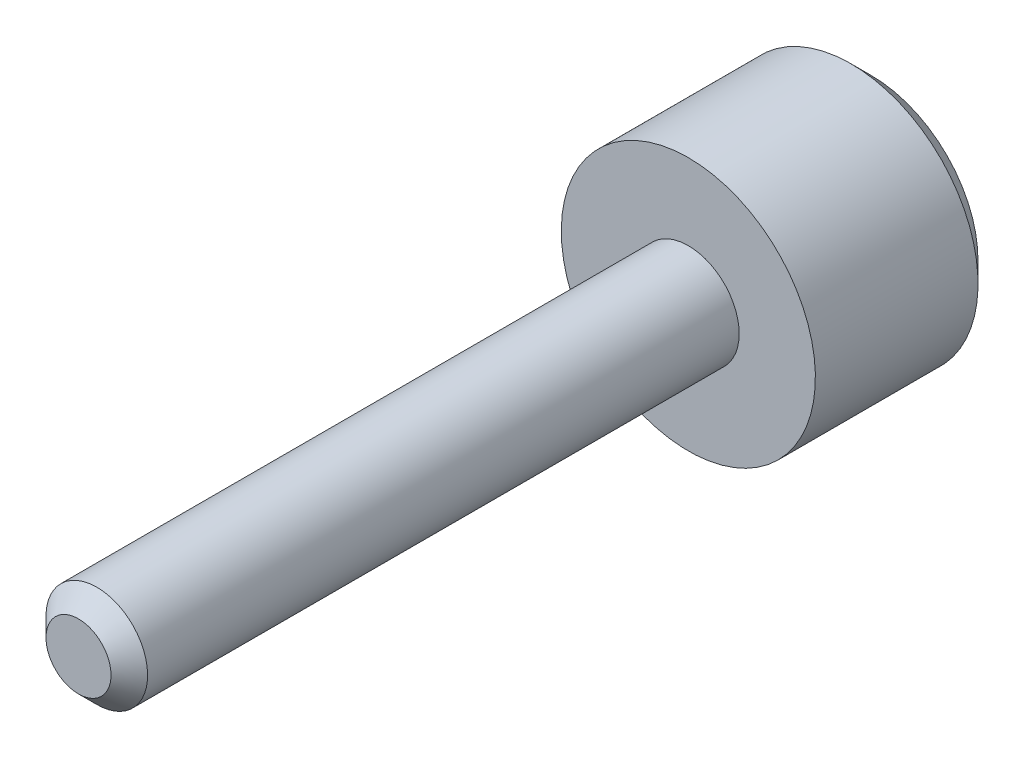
ISO-10303-21;
HEADER;
FILE_DESCRIPTION(('STEP AP214'),'2;1');
FILE_NAME('part.step','',(''),(''),'','','');
FILE_SCHEMA(('AUTOMOTIVE_DESIGN { 1 0 10303 214 1 1 1 1 }'));
ENDSEC;
DATA;
#1=APPLICATION_CONTEXT('core data for automotive mechanical design processes');
#2=APPLICATION_PROTOCOL_DEFINITION('international standard','automotive_design',2000,#1);
#3=PRODUCT_CONTEXT('',#1,'mechanical');
#4=PRODUCT('Part','Part','',(#3));
#5=PRODUCT_RELATED_PRODUCT_CATEGORY('part','',(#4));
#6=PRODUCT_DEFINITION_FORMATION('','',#4);
#7=PRODUCT_DEFINITION_CONTEXT('part definition',#1,'design');
#8=PRODUCT_DEFINITION('design','',#6,#7);
#9=PRODUCT_DEFINITION_SHAPE('','',#8);
#10=(LENGTH_UNIT() NAMED_UNIT(*) SI_UNIT(.MILLI.,.METRE.));
#11=(NAMED_UNIT(*) PLANE_ANGLE_UNIT() SI_UNIT($,.RADIAN.));
#12=(NAMED_UNIT(*) SI_UNIT($,.STERADIAN.) SOLID_ANGLE_UNIT());
#13=UNCERTAINTY_MEASURE_WITH_UNIT(LENGTH_MEASURE(1.E-05),#10,'distance_accuracy_value','');
#14=(GEOMETRIC_REPRESENTATION_CONTEXT(3) GLOBAL_UNCERTAINTY_ASSIGNED_CONTEXT((#13)) GLOBAL_UNIT_ASSIGNED_CONTEXT((#10,
#11,#12)) REPRESENTATION_CONTEXT('',''));
#15=CARTESIAN_POINT('',(0.,0.,0.));
#16=DIRECTION('',(0.,0.,1.));
#17=DIRECTION('',(1.,0.,0.));
#18=AXIS2_PLACEMENT_3D('',#15,#16,#17);
#19=CARTESIAN_POINT('',(0.,0.,0.));
#20=DIRECTION('',(0.,0.,1.));
#21=DIRECTION('',(0.5,-0.866025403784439,0.));
#22=AXIS2_PLACEMENT_3D('',#19,#20,#21);
#23=CONICAL_SURFACE('',#22,5.25,0.785398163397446);
#24=CARTESIAN_POINT('',(0.,0.,1.));
#25=DIRECTION('',(0.,0.,1.));
#26=DIRECTION('',(0.5,-0.866025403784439,0.));
#27=AXIS2_PLACEMENT_3D('',#24,#25,#26);
#28=CIRCLE('',#27,6.25);
#29=CARTESIAN_POINT('',(3.125,-5.41265877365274,1.));
#30=VERTEX_POINT('',#29);
#31=EDGE_CURVE('E94',#30,#30,#28,.T.);
#32=ORIENTED_EDGE('',*,*,#31,.F.);
#33=EDGE_LOOP('',(#32));
#34=FACE_BOUND('',#33,.T.);
#35=CARTESIAN_POINT('',(0.,0.,0.));
#36=DIRECTION('',(0.,0.,1.));
#37=DIRECTION('',(0.5,-0.866025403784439,0.));
#38=AXIS2_PLACEMENT_3D('',#35,#36,#37);
#39=CIRCLE('',#38,5.25);
#40=CARTESIAN_POINT('',(2.625,-4.5466333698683,0.));
#41=VERTEX_POINT('',#40);
#42=EDGE_CURVE('E91',#41,#41,#39,.F.);
#43=ORIENTED_EDGE('',*,*,#42,.F.);
#44=EDGE_LOOP('',(#43));
#45=FACE_BOUND('',#44,.T.);
#46=ADVANCED_FACE('F14',(#34,#45),#23,.T.);
#47=CARTESIAN_POINT('',(0.,0.,0.));
#48=DIRECTION('',(0.,0.,1.));
#49=DIRECTION('',(0.5,-0.866025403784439,0.));
#50=AXIS2_PLACEMENT_3D('',#47,#48,#49);
#51=PLANE('',#50);
#52=CARTESIAN_POINT('',(0.,0.,0.));
#53=DIRECTION('',(0.,0.,-1.));
#54=DIRECTION('',(-1.,0.,0.));
#55=AXIS2_PLACEMENT_3D('',#52,#53,#54);
#56=CIRCLE('',#55,2.75);
#57=CARTESIAN_POINT('',(-2.75,0.,0.));
#58=VERTEX_POINT('',#57);
#59=EDGE_CURVE('E305',#58,#58,#56,.T.);
#60=ORIENTED_EDGE('',*,*,#59,.F.);
#61=EDGE_LOOP('',(#60));
#62=FACE_BOUND('',#61,.T.);
#63=ORIENTED_EDGE('',*,*,#42,.T.);
#64=EDGE_LOOP('',(#63));
#65=FACE_BOUND('',#64,.T.);
#66=ADVANCED_FACE('F141',(#62,#65),#51,.F.);
#67=CARTESIAN_POINT('',(0.,0.,0.));
#68=DIRECTION('',(0.,0.,-1.));
#69=DIRECTION('',(-0.5,0.866025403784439,0.));
#70=AXIS2_PLACEMENT_3D('',#67,#68,#69);
#71=CYLINDRICAL_SURFACE('',#70,6.25);
#72=ORIENTED_EDGE('',*,*,#31,.T.);
#73=EDGE_LOOP('',(#72));
#74=FACE_BOUND('',#73,.T.);
#75=CARTESIAN_POINT('',(0.,0.,9.));
#76=DIRECTION('',(0.,0.,-1.));
#77=DIRECTION('',(-0.5,0.866025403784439,0.));
#78=AXIS2_PLACEMENT_3D('',#75,#76,#77);
#79=CIRCLE('',#78,6.25);
#80=CARTESIAN_POINT('',(-3.125,5.41265877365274,9.));
#81=VERTEX_POINT('',#80);
#82=EDGE_CURVE('E88',#81,#81,#79,.T.);
#83=ORIENTED_EDGE('',*,*,#82,.T.);
#84=EDGE_LOOP('',(#83));
#85=FACE_BOUND('',#84,.T.);
#86=ADVANCED_FACE('F131',(#74,#85),#71,.T.);
#87=CARTESIAN_POINT('',(3.68060796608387,2.125,9.));
#88=DIRECTION('',(0.,0.,-1.));
#89=DIRECTION('',(-0.5,0.866025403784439,0.));
#90=AXIS2_PLACEMENT_3D('',#87,#88,#89);
#91=PLANE('',#90);
#92=ORIENTED_EDGE('',*,*,#82,.F.);
#93=EDGE_LOOP('',(#92));
#94=FACE_BOUND('',#93,.T.);
#95=CARTESIAN_POINT('',(0.,0.,9.));
#96=DIRECTION('',(0.,0.,-1.));
#97=DIRECTION('',(-0.5,0.866025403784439,0.));
#98=AXIS2_PLACEMENT_3D('',#95,#96,#97);
#99=CIRCLE('',#98,2.5);
#100=CARTESIAN_POINT('',(-1.25,2.1650635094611,9.));
#101=VERTEX_POINT('',#100);
#102=EDGE_CURVE('E80',#101,#101,#99,.T.);
#103=ORIENTED_EDGE('',*,*,#102,.T.);
#104=EDGE_LOOP('',(#103));
#105=FACE_BOUND('',#104,.T.);
#106=ADVANCED_FACE('F129',(#94,#105),#91,.F.);
#107=CARTESIAN_POINT('',(-1.25,2.1650635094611,39.));
#108=DIRECTION('',(0.,0.,1.));
#109=DIRECTION('',(0.5,-0.866025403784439,0.));
#110=AXIS2_PLACEMENT_3D('',#107,#108,#109);
#111=PLANE('',#110);
#112=CARTESIAN_POINT('',(0.,0.,39.));
#113=DIRECTION('',(0.,0.,1.));
#114=DIRECTION('',(0.866025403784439,0.5,0.));
#115=AXIS2_PLACEMENT_3D('',#112,#113,#114);
#116=CIRCLE('',#115,1.6);
#117=CARTESIAN_POINT('',(1.38564064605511,0.800000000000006,39.));
#118=VERTEX_POINT('',#117);
#119=EDGE_CURVE('E22',#118,#118,#116,.T.);
#120=ORIENTED_EDGE('',*,*,#119,.T.);
#121=EDGE_LOOP('',(#120));
#122=FACE_BOUND('',#121,.T.);
#123=ADVANCED_FACE('F118',(#122),#111,.T.);
#124=CARTESIAN_POINT('',(0.,0.,19.));
#125=DIRECTION('',(0.,0.,-1.));
#126=DIRECTION('',(-0.5,0.866025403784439,0.));
#127=AXIS2_PLACEMENT_3D('',#124,#125,#126);
#128=CYLINDRICAL_SURFACE('',#127,2.5);
#129=CARTESIAN_POINT('',(0.,0.,38.1));
#130=DIRECTION('',(0.,0.,1.));
#131=DIRECTION('',(0.866025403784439,0.5,0.));
#132=AXIS2_PLACEMENT_3D('',#129,#130,#131);
#133=CIRCLE('',#132,2.5);
#134=CARTESIAN_POINT('',(2.16506350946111,1.25000000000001,38.1));
#135=VERTEX_POINT('',#134);
#136=EDGE_CURVE('E97',#135,#135,#133,.F.);
#137=ORIENTED_EDGE('',*,*,#136,.T.);
#138=EDGE_LOOP('',(#137));
#139=FACE_BOUND('',#138,.T.);
#140=ORIENTED_EDGE('',*,*,#102,.F.);
#141=EDGE_LOOP('',(#140));
#142=FACE_BOUND('',#141,.T.);
#143=ADVANCED_FACE('F122',(#139,#142),#128,.T.);
#144=CARTESIAN_POINT('',(0.,0.,38.1));
#145=DIRECTION('',(0.,0.,-1.));
#146=DIRECTION('',(-0.866025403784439,-0.5,0.));
#147=AXIS2_PLACEMENT_3D('',#144,#145,#146);
#148=CONICAL_SURFACE('',#147,2.5,0.785398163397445);
#149=ORIENTED_EDGE('',*,*,#119,.F.);
#150=EDGE_LOOP('',(#149));
#151=FACE_BOUND('',#150,.T.);
#152=ORIENTED_EDGE('',*,*,#136,.F.);
#153=EDGE_LOOP('',(#152));
#154=FACE_BOUND('',#153,.T.);
#155=ADVANCED_FACE('F16',(#151,#154),#148,.T.);
#156=CARTESIAN_POINT('',(0.,0.,4.));
#157=DIRECTION('',(0.,0.,-1.));
#158=DIRECTION('',(-1.,0.,0.));
#159=AXIS2_PLACEMENT_3D('',#156,#157,#158);
#160=PLANE('',#159);
#161=CARTESIAN_POINT('',(0.,0.,4.));
#162=DIRECTION('',(0.,0.,-1.));
#163=DIRECTION('',(-1.,0.,0.));
#164=AXIS2_PLACEMENT_3D('',#161,#162,#163);
#165=CIRCLE('',#164,2.75);
#166=CARTESIAN_POINT('',(-2.75,0.,4.));
#167=VERTEX_POINT('',#166);
#168=EDGE_CURVE('E73',#167,#167,#165,.T.);
#169=ORIENTED_EDGE('',*,*,#168,.T.);
#170=EDGE_LOOP('',(#169));
#171=FACE_BOUND('',#170,.T.);
#172=DIRECTION('',(-0.866025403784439,-0.5,0.));
#173=VECTOR('',#172,1.);
#174=CARTESIAN_POINT('',(-2.,1.15470053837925,4.));
#175=LINE('',#174,#173);
#176=CARTESIAN_POINT('',(0.,2.30940107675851,4.));
#177=VERTEX_POINT('',#176);
#178=CARTESIAN_POINT('',(-2.,1.15470053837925,4.));
#179=VERTEX_POINT('',#178);
#180=EDGE_CURVE('E112',#177,#179,#175,.T.);
#181=ORIENTED_EDGE('',*,*,#180,.T.);
#182=DIRECTION('',(0.,-1.,0.));
#183=VECTOR('',#182,1.);
#184=CARTESIAN_POINT('',(-2.,-1.15470053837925,4.));
#185=LINE('',#184,#183);
#186=CARTESIAN_POINT('',(-2.,-1.15470053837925,4.));
#187=VERTEX_POINT('',#186);
#188=EDGE_CURVE('E192',#179,#187,#185,.T.);
#189=ORIENTED_EDGE('',*,*,#188,.T.);
#190=DIRECTION('',(0.866025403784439,-0.5,0.));
#191=VECTOR('',#190,1.);
#192=CARTESIAN_POINT('',(0.,-2.30940107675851,4.));
#193=LINE('',#192,#191);
#194=CARTESIAN_POINT('',(0.,-2.3094010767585,4.));
#195=VERTEX_POINT('',#194);
#196=EDGE_CURVE('E187',#187,#195,#193,.T.);
#197=ORIENTED_EDGE('',*,*,#196,.T.);
#198=DIRECTION('',(0.866025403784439,0.5,0.));
#199=VECTOR('',#198,1.);
#200=CARTESIAN_POINT('',(2.,-1.15470053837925,4.));
#201=LINE('',#200,#199);
#202=CARTESIAN_POINT('',(2.,-1.15470053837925,4.));
#203=VERTEX_POINT('',#202);
#204=EDGE_CURVE('E28',#195,#203,#201,.T.);
#205=ORIENTED_EDGE('',*,*,#204,.T.);
#206=DIRECTION('',(0.,1.,0.));
#207=VECTOR('',#206,1.);
#208=CARTESIAN_POINT('',(2.,1.15470053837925,4.));
#209=LINE('',#208,#207);
#210=CARTESIAN_POINT('',(2.,1.15470053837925,4.));
#211=VERTEX_POINT('',#210);
#212=EDGE_CURVE('E9',#203,#211,#209,.T.);
#213=ORIENTED_EDGE('',*,*,#212,.T.);
#214=DIRECTION('',(-0.866025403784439,0.5,0.));
#215=VECTOR('',#214,1.);
#216=CARTESIAN_POINT('',(0.,2.30940107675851,4.));
#217=LINE('',#216,#215);
#218=EDGE_CURVE('E66',#211,#177,#217,.T.);
#219=ORIENTED_EDGE('',*,*,#218,.T.);
#220=EDGE_LOOP('',(#181,#189,#197,#205,#213,#219));
#221=FACE_BOUND('',#220,.T.);
#222=ADVANCED_FACE('F65',(#171,#221),#160,.T.);
#223=CARTESIAN_POINT('',(0.,0.,4.));
#224=DIRECTION('',(0.,0.,-1.));
#225=DIRECTION('',(-1.,0.,0.));
#226=AXIS2_PLACEMENT_3D('',#223,#224,#225);
#227=CYLINDRICAL_SURFACE('',#226,2.75);
#228=ORIENTED_EDGE('',*,*,#168,.F.);
#229=EDGE_LOOP('',(#228));
#230=FACE_BOUND('',#229,.T.);
#231=ORIENTED_EDGE('',*,*,#59,.T.);
#232=EDGE_LOOP('',(#231));
#233=FACE_BOUND('',#232,.T.);
#234=ADVANCED_FACE('F159',(#230,#233),#227,.F.);
#235=CARTESIAN_POINT('',(4.,0.,6.5));
#236=DIRECTION('',(0.,0.,1.));
#237=DIRECTION('',(0.5,-0.866025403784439,0.));
#238=AXIS2_PLACEMENT_3D('',#235,#236,#237);
#239=PLANE('',#238);
#240=DIRECTION('',(-0.866025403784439,0.5,0.));
#241=VECTOR('',#240,1.);
#242=CARTESIAN_POINT('',(2.,1.15470053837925,6.5));
#243=LINE('',#242,#241);
#244=CARTESIAN_POINT('',(2.,1.15470053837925,6.5));
#245=VERTEX_POINT('',#244);
#246=CARTESIAN_POINT('',(0.,2.30940107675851,6.5));
#247=VERTEX_POINT('',#246);
#248=EDGE_CURVE('E111',#245,#247,#243,.T.);
#249=ORIENTED_EDGE('',*,*,#248,.F.);
#250=DIRECTION('',(0.,-1.,0.));
#251=VECTOR('',#250,1.);
#252=CARTESIAN_POINT('',(2.,1.15470053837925,6.5));
#253=LINE('',#252,#251);
#254=CARTESIAN_POINT('',(2.,-1.15470053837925,6.5));
#255=VERTEX_POINT('',#254);
#256=EDGE_CURVE('E78',#245,#255,#253,.T.);
#257=ORIENTED_EDGE('',*,*,#256,.T.);
#258=DIRECTION('',(-0.866025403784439,-0.5,0.));
#259=VECTOR('',#258,1.);
#260=CARTESIAN_POINT('',(2.,-1.15470053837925,6.5));
#261=LINE('',#260,#259);
#262=CARTESIAN_POINT('',(0.,-2.30940107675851,6.5));
#263=VERTEX_POINT('',#262);
#264=EDGE_CURVE('E99',#255,#263,#261,.T.);
#265=ORIENTED_EDGE('',*,*,#264,.T.);
#266=DIRECTION('',(0.866025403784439,-0.5,0.));
#267=VECTOR('',#266,1.);
#268=CARTESIAN_POINT('',(-2.,-1.15470053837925,6.5));
#269=LINE('',#268,#267);
#270=CARTESIAN_POINT('',(-2.,-1.15470053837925,6.5));
#271=VERTEX_POINT('',#270);
#272=EDGE_CURVE('E102',#271,#263,#269,.T.);
#273=ORIENTED_EDGE('',*,*,#272,.F.);
#274=DIRECTION('',(0.,1.,0.));
#275=VECTOR('',#274,1.);
#276=CARTESIAN_POINT('',(-2.,-1.15470053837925,6.5));
#277=LINE('',#276,#275);
#278=CARTESIAN_POINT('',(-2.,1.15470053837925,6.5));
#279=VERTEX_POINT('',#278);
#280=EDGE_CURVE('E105',#271,#279,#277,.T.);
#281=ORIENTED_EDGE('',*,*,#280,.T.);
#282=DIRECTION('',(0.866025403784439,0.5,0.));
#283=VECTOR('',#282,1.);
#284=CARTESIAN_POINT('',(-2.,1.15470053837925,6.5));
#285=LINE('',#284,#283);
#286=EDGE_CURVE('E108',#279,#247,#285,.T.);
#287=ORIENTED_EDGE('',*,*,#286,.T.);
#288=EDGE_LOOP('',(#249,#257,#265,#273,#281,#287));
#289=FACE_BOUND('',#288,.T.);
#290=ADVANCED_FACE('F157',(#289),#239,.F.);
#291=CARTESIAN_POINT('',(2.,1.15470053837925,10.));
#292=DIRECTION('',(1.,0.,0.));
#293=DIRECTION('',(0.,1.,0.));
#294=AXIS2_PLACEMENT_3D('',#291,#292,#293);
#295=PLANE('',#294);
#296=ORIENTED_EDGE('',*,*,#212,.F.);
#297=DIRECTION('',(0.,0.,-1.));
#298=VECTOR('',#297,1.);
#299=CARTESIAN_POINT('',(2.,-1.15470053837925,10.));
#300=LINE('',#299,#298);
#301=EDGE_CURVE('E79',#255,#203,#300,.T.);
#302=ORIENTED_EDGE('',*,*,#301,.F.);
#303=ORIENTED_EDGE('',*,*,#256,.F.);
#304=DIRECTION('',(0.,0.,-1.));
#305=VECTOR('',#304,1.);
#306=CARTESIAN_POINT('',(2.,1.15470053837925,10.));
#307=LINE('',#306,#305);
#308=EDGE_CURVE('E36',#245,#211,#307,.T.);
#309=ORIENTED_EDGE('',*,*,#308,.T.);
#310=EDGE_LOOP('',(#296,#302,#303,#309));
#311=FACE_BOUND('',#310,.T.);
#312=ADVANCED_FACE('F76',(#311),#295,.F.);
#313=CARTESIAN_POINT('',(0.,2.30940107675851,10.));
#314=DIRECTION('',(0.5,0.866025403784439,0.));
#315=DIRECTION('',(-0.866025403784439,0.5,0.));
#316=AXIS2_PLACEMENT_3D('',#313,#314,#315);
#317=PLANE('',#316);
#318=ORIENTED_EDGE('',*,*,#218,.F.);
#319=ORIENTED_EDGE('',*,*,#308,.F.);
#320=ORIENTED_EDGE('',*,*,#248,.T.);
#321=DIRECTION('',(0.,0.,-1.));
#322=VECTOR('',#321,1.);
#323=CARTESIAN_POINT('',(0.,2.30940107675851,10.));
#324=LINE('',#323,#322);
#325=EDGE_CURVE('E72',#247,#177,#324,.T.);
#326=ORIENTED_EDGE('',*,*,#325,.T.);
#327=EDGE_LOOP('',(#318,#319,#320,#326));
#328=FACE_BOUND('',#327,.T.);
#329=ADVANCED_FACE('F71',(#328),#317,.F.);
#330=CARTESIAN_POINT('',(2.,-1.15470053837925,10.));
#331=DIRECTION('',(0.5,-0.866025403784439,0.));
#332=DIRECTION('',(0.866025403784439,0.5,0.));
#333=AXIS2_PLACEMENT_3D('',#330,#331,#332);
#334=PLANE('',#333);
#335=ORIENTED_EDGE('',*,*,#204,.F.);
#336=DIRECTION('',(0.,0.,-1.));
#337=VECTOR('',#336,1.);
#338=CARTESIAN_POINT('',(0.,-2.30940107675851,10.));
#339=LINE('',#338,#337);
#340=EDGE_CURVE('E82',#263,#195,#339,.T.);
#341=ORIENTED_EDGE('',*,*,#340,.F.);
#342=ORIENTED_EDGE('',*,*,#264,.F.);
#343=ORIENTED_EDGE('',*,*,#301,.T.);
#344=EDGE_LOOP('',(#335,#341,#342,#343));
#345=FACE_BOUND('',#344,.T.);
#346=ADVANCED_FACE('F190',(#345),#334,.F.);
#347=CARTESIAN_POINT('',(0.,-2.30940107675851,10.));
#348=DIRECTION('',(-0.5,-0.866025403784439,0.));
#349=DIRECTION('',(0.866025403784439,-0.5,0.));
#350=AXIS2_PLACEMENT_3D('',#347,#348,#349);
#351=PLANE('',#350);
#352=ORIENTED_EDGE('',*,*,#196,.F.);
#353=DIRECTION('',(0.,0.,-1.));
#354=VECTOR('',#353,1.);
#355=CARTESIAN_POINT('',(-2.,-1.15470053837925,10.));
#356=LINE('',#355,#354);
#357=EDGE_CURVE('E177',#271,#187,#356,.T.);
#358=ORIENTED_EDGE('',*,*,#357,.F.);
#359=ORIENTED_EDGE('',*,*,#272,.T.);
#360=ORIENTED_EDGE('',*,*,#340,.T.);
#361=EDGE_LOOP('',(#352,#358,#359,#360));
#362=FACE_BOUND('',#361,.T.);
#363=ADVANCED_FACE('F186',(#362),#351,.F.);
#364=CARTESIAN_POINT('',(-2.,-1.15470053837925,10.));
#365=DIRECTION('',(-1.,0.,0.));
#366=DIRECTION('',(0.,-1.,0.));
#367=AXIS2_PLACEMENT_3D('',#364,#365,#366);
#368=PLANE('',#367);
#369=ORIENTED_EDGE('',*,*,#188,.F.);
#370=DIRECTION('',(0.,0.,-1.));
#371=VECTOR('',#370,1.);
#372=CARTESIAN_POINT('',(-2.,1.15470053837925,10.));
#373=LINE('',#372,#371);
#374=EDGE_CURVE('E175',#279,#179,#373,.T.);
#375=ORIENTED_EDGE('',*,*,#374,.F.);
#376=ORIENTED_EDGE('',*,*,#280,.F.);
#377=ORIENTED_EDGE('',*,*,#357,.T.);
#378=EDGE_LOOP('',(#369,#375,#376,#377));
#379=FACE_BOUND('',#378,.T.);
#380=ADVANCED_FACE('F197',(#379),#368,.F.);
#381=CARTESIAN_POINT('',(-2.,1.15470053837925,10.));
#382=DIRECTION('',(-0.5,0.866025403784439,0.));
#383=DIRECTION('',(-0.866025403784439,-0.5,0.));
#384=AXIS2_PLACEMENT_3D('',#381,#382,#383);
#385=PLANE('',#384);
#386=ORIENTED_EDGE('',*,*,#180,.F.);
#387=ORIENTED_EDGE('',*,*,#325,.F.);
#388=ORIENTED_EDGE('',*,*,#286,.F.);
#389=ORIENTED_EDGE('',*,*,#374,.T.);
#390=EDGE_LOOP('',(#386,#387,#388,#389));
#391=FACE_BOUND('',#390,.T.);
#392=ADVANCED_FACE('F174',(#391),#385,.F.);
#393=CLOSED_SHELL('',(#46,#66,#86,#106,#123,#143,#155,#222,#234,#290,#312,#329,#346,#363,#380,#392));
#394=MANIFOLD_SOLID_BREP('B1',#393);
#395=ADVANCED_BREP_SHAPE_REPRESENTATION('',(#18,#394),#14);
#396=SHAPE_DEFINITION_REPRESENTATION(#9,#395);
ENDSEC;
END-ISO-10303-21;
